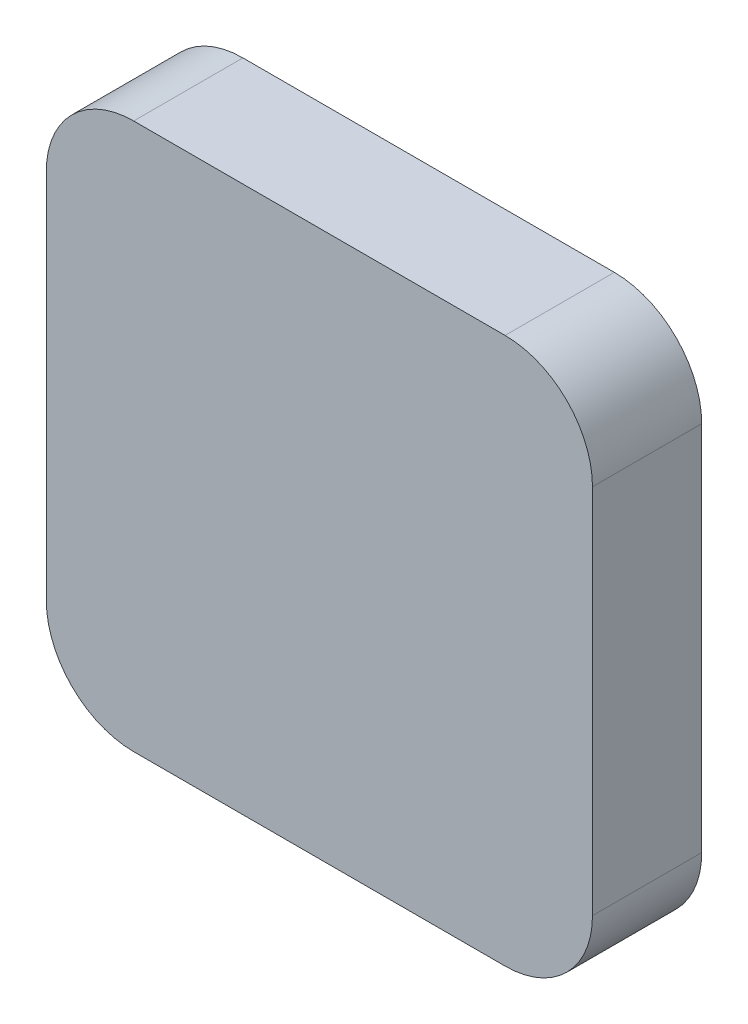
ISO-10303-21;
HEADER;
FILE_DESCRIPTION(('STEP AP214'),'2;1');
FILE_NAME('part.step','',(''),(''),'','','');
FILE_SCHEMA(('AUTOMOTIVE_DESIGN { 1 0 10303 214 1 1 1 1 }'));
ENDSEC;
DATA;
#1=APPLICATION_CONTEXT('core data for automotive mechanical design processes');
#2=APPLICATION_PROTOCOL_DEFINITION('international standard','automotive_design',2000,#1);
#3=PRODUCT_CONTEXT('',#1,'mechanical');
#4=PRODUCT('Part','Part','',(#3));
#5=PRODUCT_RELATED_PRODUCT_CATEGORY('part','',(#4));
#6=PRODUCT_DEFINITION_FORMATION('','',#4);
#7=PRODUCT_DEFINITION_CONTEXT('part definition',#1,'design');
#8=PRODUCT_DEFINITION('design','',#6,#7);
#9=PRODUCT_DEFINITION_SHAPE('','',#8);
#10=(LENGTH_UNIT() NAMED_UNIT(*) SI_UNIT(.MILLI.,.METRE.));
#11=(NAMED_UNIT(*) PLANE_ANGLE_UNIT() SI_UNIT($,.RADIAN.));
#12=(NAMED_UNIT(*) SI_UNIT($,.STERADIAN.) SOLID_ANGLE_UNIT());
#13=UNCERTAINTY_MEASURE_WITH_UNIT(LENGTH_MEASURE(1.E-05),#10,'distance_accuracy_value','');
#14=(GEOMETRIC_REPRESENTATION_CONTEXT(3) GLOBAL_UNCERTAINTY_ASSIGNED_CONTEXT((#13)) GLOBAL_UNIT_ASSIGNED_CONTEXT((#10,
#11,#12)) REPRESENTATION_CONTEXT('',''));
#15=CARTESIAN_POINT('',(0.,0.,0.));
#16=DIRECTION('',(0.,0.,1.));
#17=DIRECTION('',(1.,0.,0.));
#18=AXIS2_PLACEMENT_3D('',#15,#16,#17);
#19=CARTESIAN_POINT('',(12.5,12.5,5.));
#20=DIRECTION('',(-1.,0.,0.));
#21=DIRECTION('',(0.,-1.,0.));
#22=AXIS2_PLACEMENT_3D('',#19,#20,#21);
#23=PLANE('',#22);
#24=DIRECTION('',(0.,1.,0.));
#25=VECTOR('',#24,1.);
#26=CARTESIAN_POINT('',(12.5,12.5,5.));
#27=LINE('',#26,#25);
#28=CARTESIAN_POINT('',(12.5,-8.5,5.));
#29=VERTEX_POINT('',#28);
#30=CARTESIAN_POINT('',(12.5,8.5,5.));
#31=VERTEX_POINT('',#30);
#32=EDGE_CURVE('E120',#29,#31,#27,.T.);
#33=ORIENTED_EDGE('',*,*,#32,.F.);
#34=DIRECTION('',(0.,0.,-1.));
#35=VECTOR('',#34,1.);
#36=CARTESIAN_POINT('',(12.5,-8.5,5.));
#37=LINE('',#36,#35);
#38=CARTESIAN_POINT('',(12.5,-8.5,0.));
#39=VERTEX_POINT('',#38);
#40=EDGE_CURVE('E105',#29,#39,#37,.T.);
#41=ORIENTED_EDGE('',*,*,#40,.T.);
#42=DIRECTION('',(0.,1.,0.));
#43=VECTOR('',#42,1.);
#44=CARTESIAN_POINT('',(12.5,12.5,0.));
#45=LINE('',#44,#43);
#46=CARTESIAN_POINT('',(12.5,8.5,0.));
#47=VERTEX_POINT('',#46);
#48=EDGE_CURVE('E117',#39,#47,#45,.T.);
#49=ORIENTED_EDGE('',*,*,#48,.T.);
#50=DIRECTION('',(0.,0.,-1.));
#51=VECTOR('',#50,1.);
#52=CARTESIAN_POINT('',(12.5,8.5,5.));
#53=LINE('',#52,#51);
#54=EDGE_CURVE('E122',#47,#31,#53,.F.);
#55=ORIENTED_EDGE('',*,*,#54,.T.);
#56=EDGE_LOOP('',(#33,#41,#49,#55));
#57=FACE_BOUND('',#56,.T.);
#58=ADVANCED_FACE('F35',(#57),#23,.F.);
#59=CARTESIAN_POINT('',(-12.5,12.5,5.));
#60=DIRECTION('',(0.,-1.,0.));
#61=DIRECTION('',(0.,0.,-1.));
#62=AXIS2_PLACEMENT_3D('',#59,#60,#61);
#63=PLANE('',#62);
#64=DIRECTION('',(-1.,0.,0.));
#65=VECTOR('',#64,1.);
#66=CARTESIAN_POINT('',(-12.5,12.5,0.));
#67=LINE('',#66,#65);
#68=CARTESIAN_POINT('',(8.5,12.5,0.));
#69=VERTEX_POINT('',#68);
#70=CARTESIAN_POINT('',(-8.5,12.5,0.));
#71=VERTEX_POINT('',#70);
#72=EDGE_CURVE('E126',#69,#71,#67,.T.);
#73=ORIENTED_EDGE('',*,*,#72,.T.);
#74=DIRECTION('',(0.,0.,-1.));
#75=VECTOR('',#74,1.);
#76=CARTESIAN_POINT('',(-8.5,12.5,5.));
#77=LINE('',#76,#75);
#78=CARTESIAN_POINT('',(-8.5,12.5,5.));
#79=VERTEX_POINT('',#78);
#80=EDGE_CURVE('E11',#71,#79,#77,.F.);
#81=ORIENTED_EDGE('',*,*,#80,.T.);
#82=DIRECTION('',(-1.,0.,0.));
#83=VECTOR('',#82,1.);
#84=CARTESIAN_POINT('',(-12.5,12.5,5.));
#85=LINE('',#84,#83);
#86=CARTESIAN_POINT('',(8.5,12.5,5.));
#87=VERTEX_POINT('',#86);
#88=EDGE_CURVE('E162',#87,#79,#85,.T.);
#89=ORIENTED_EDGE('',*,*,#88,.F.);
#90=DIRECTION('',(0.,0.,-1.));
#91=VECTOR('',#90,1.);
#92=CARTESIAN_POINT('',(8.5,12.5,5.));
#93=LINE('',#92,#91);
#94=EDGE_CURVE('E43',#87,#69,#93,.T.);
#95=ORIENTED_EDGE('',*,*,#94,.T.);
#96=EDGE_LOOP('',(#73,#81,#89,#95));
#97=FACE_BOUND('',#96,.T.);
#98=ADVANCED_FACE('F160',(#97),#63,.F.);
#99=CARTESIAN_POINT('',(-12.5,12.5,5.));
#100=DIRECTION('',(1.,0.,0.));
#101=DIRECTION('',(0.,1.,0.));
#102=AXIS2_PLACEMENT_3D('',#99,#100,#101);
#103=PLANE('',#102);
#104=DIRECTION('',(0.,-1.,0.));
#105=VECTOR('',#104,1.);
#106=CARTESIAN_POINT('',(-12.5,12.5,0.));
#107=LINE('',#106,#105);
#108=CARTESIAN_POINT('',(-12.5,8.5,0.));
#109=VERTEX_POINT('',#108);
#110=CARTESIAN_POINT('',(-12.5,-8.5,0.));
#111=VERTEX_POINT('',#110);
#112=EDGE_CURVE('E129',#109,#111,#107,.T.);
#113=ORIENTED_EDGE('',*,*,#112,.T.);
#114=DIRECTION('',(0.,0.,-1.));
#115=VECTOR('',#114,1.);
#116=CARTESIAN_POINT('',(-12.5,-8.5,5.));
#117=LINE('',#116,#115);
#118=CARTESIAN_POINT('',(-12.5,-8.5,5.));
#119=VERTEX_POINT('',#118);
#120=EDGE_CURVE('E50',#111,#119,#117,.F.);
#121=ORIENTED_EDGE('',*,*,#120,.T.);
#122=DIRECTION('',(0.,-1.,0.));
#123=VECTOR('',#122,1.);
#124=CARTESIAN_POINT('',(-12.5,12.5,5.));
#125=LINE('',#124,#123);
#126=CARTESIAN_POINT('',(-12.5,8.5,5.));
#127=VERTEX_POINT('',#126);
#128=EDGE_CURVE('E170',#127,#119,#125,.T.);
#129=ORIENTED_EDGE('',*,*,#128,.F.);
#130=DIRECTION('',(0.,0.,-1.));
#131=VECTOR('',#130,1.);
#132=CARTESIAN_POINT('',(-12.5,8.5,5.));
#133=LINE('',#132,#131);
#134=EDGE_CURVE('E153',#127,#109,#133,.T.);
#135=ORIENTED_EDGE('',*,*,#134,.T.);
#136=EDGE_LOOP('',(#113,#121,#129,#135));
#137=FACE_BOUND('',#136,.T.);
#138=ADVANCED_FACE('F169',(#137),#103,.F.);
#139=CARTESIAN_POINT('',(-12.5,-12.5,5.));
#140=DIRECTION('',(0.,1.,0.));
#141=DIRECTION('',(0.,0.,1.));
#142=AXIS2_PLACEMENT_3D('',#139,#140,#141);
#143=PLANE('',#142);
#144=DIRECTION('',(1.,0.,0.));
#145=VECTOR('',#144,1.);
#146=CARTESIAN_POINT('',(-12.5,-12.5,0.));
#147=LINE('',#146,#145);
#148=CARTESIAN_POINT('',(-8.5,-12.5,0.));
#149=VERTEX_POINT('',#148);
#150=CARTESIAN_POINT('',(8.5,-12.5,0.));
#151=VERTEX_POINT('',#150);
#152=EDGE_CURVE('E136',#149,#151,#147,.T.);
#153=ORIENTED_EDGE('',*,*,#152,.T.);
#154=DIRECTION('',(0.,0.,-1.));
#155=VECTOR('',#154,1.);
#156=CARTESIAN_POINT('',(8.5,-12.5,5.));
#157=LINE('',#156,#155);
#158=CARTESIAN_POINT('',(8.5,-12.5,5.));
#159=VERTEX_POINT('',#158);
#160=EDGE_CURVE('E106',#151,#159,#157,.F.);
#161=ORIENTED_EDGE('',*,*,#160,.T.);
#162=DIRECTION('',(1.,0.,0.));
#163=VECTOR('',#162,1.);
#164=CARTESIAN_POINT('',(-12.5,-12.5,5.));
#165=LINE('',#164,#163);
#166=CARTESIAN_POINT('',(-8.5,-12.5,5.));
#167=VERTEX_POINT('',#166);
#168=EDGE_CURVE('E132',#167,#159,#165,.T.);
#169=ORIENTED_EDGE('',*,*,#168,.F.);
#170=DIRECTION('',(0.,0.,-1.));
#171=VECTOR('',#170,1.);
#172=CARTESIAN_POINT('',(-8.5,-12.5,5.));
#173=LINE('',#172,#171);
#174=EDGE_CURVE('E111',#167,#149,#173,.T.);
#175=ORIENTED_EDGE('',*,*,#174,.T.);
#176=EDGE_LOOP('',(#153,#161,#169,#175));
#177=FACE_BOUND('',#176,.T.);
#178=ADVANCED_FACE('F198',(#177),#143,.F.);
#179=CARTESIAN_POINT('',(12.5,-12.5,5.));
#180=DIRECTION('',(0.,0.,1.));
#181=DIRECTION('',(1.,0.,0.));
#182=AXIS2_PLACEMENT_3D('',#179,#180,#181);
#183=PLANE('',#182);
#184=ORIENTED_EDGE('',*,*,#168,.T.);
#185=CARTESIAN_POINT('',(8.5,-8.5,5.));
#186=DIRECTION('',(0.,0.,1.));
#187=DIRECTION('',(1.,0.,0.));
#188=AXIS2_PLACEMENT_3D('',#185,#186,#187);
#189=CIRCLE('',#188,4.);
#190=EDGE_CURVE('E151',#159,#29,#189,.T.);
#191=ORIENTED_EDGE('',*,*,#190,.T.);
#192=ORIENTED_EDGE('',*,*,#32,.T.);
#193=CARTESIAN_POINT('',(8.5,8.5,5.));
#194=DIRECTION('',(0.,0.,1.));
#195=DIRECTION('',(1.,0.,0.));
#196=AXIS2_PLACEMENT_3D('',#193,#194,#195);
#197=CIRCLE('',#196,4.);
#198=EDGE_CURVE('E146',#31,#87,#197,.T.);
#199=ORIENTED_EDGE('',*,*,#198,.T.);
#200=ORIENTED_EDGE('',*,*,#88,.T.);
#201=CARTESIAN_POINT('',(-8.5,8.5,5.));
#202=DIRECTION('',(0.,0.,1.));
#203=DIRECTION('',(1.,0.,0.));
#204=AXIS2_PLACEMENT_3D('',#201,#202,#203);
#205=CIRCLE('',#204,4.);
#206=EDGE_CURVE('E57',#79,#127,#205,.T.);
#207=ORIENTED_EDGE('',*,*,#206,.T.);
#208=ORIENTED_EDGE('',*,*,#128,.T.);
#209=CARTESIAN_POINT('',(-8.5,-8.5,5.));
#210=DIRECTION('',(0.,0.,1.));
#211=DIRECTION('',(1.,0.,0.));
#212=AXIS2_PLACEMENT_3D('',#209,#210,#211);
#213=CIRCLE('',#212,4.);
#214=EDGE_CURVE('E149',#119,#167,#213,.T.);
#215=ORIENTED_EDGE('',*,*,#214,.T.);
#216=EDGE_LOOP('',(#184,#191,#192,#199,#200,#207,#208,#215));
#217=FACE_BOUND('',#216,.T.);
#218=ADVANCED_FACE('F175',(#217),#183,.T.);
#219=CARTESIAN_POINT('',(12.5,-12.5,0.));
#220=DIRECTION('',(0.,0.,1.));
#221=DIRECTION('',(1.,0.,0.));
#222=AXIS2_PLACEMENT_3D('',#219,#220,#221);
#223=PLANE('',#222);
#224=ORIENTED_EDGE('',*,*,#48,.F.);
#225=CARTESIAN_POINT('',(8.5,-8.5,0.));
#226=DIRECTION('',(0.,0.,1.));
#227=DIRECTION('',(1.,0.,0.));
#228=AXIS2_PLACEMENT_3D('',#225,#226,#227);
#229=CIRCLE('',#228,4.);
#230=EDGE_CURVE('E101',#39,#151,#229,.F.);
#231=ORIENTED_EDGE('',*,*,#230,.T.);
#232=ORIENTED_EDGE('',*,*,#152,.F.);
#233=CARTESIAN_POINT('',(-8.5,-8.5,0.));
#234=DIRECTION('',(0.,0.,1.));
#235=DIRECTION('',(1.,0.,0.));
#236=AXIS2_PLACEMENT_3D('',#233,#234,#235);
#237=CIRCLE('',#236,4.);
#238=EDGE_CURVE('E112',#149,#111,#237,.F.);
#239=ORIENTED_EDGE('',*,*,#238,.T.);
#240=ORIENTED_EDGE('',*,*,#112,.F.);
#241=CARTESIAN_POINT('',(-8.5,8.5,0.));
#242=DIRECTION('',(0.,0.,1.));
#243=DIRECTION('',(1.,0.,0.));
#244=AXIS2_PLACEMENT_3D('',#241,#242,#243);
#245=CIRCLE('',#244,4.);
#246=EDGE_CURVE('E140',#109,#71,#245,.F.);
#247=ORIENTED_EDGE('',*,*,#246,.T.);
#248=ORIENTED_EDGE('',*,*,#72,.F.);
#249=CARTESIAN_POINT('',(8.5,8.5,0.));
#250=DIRECTION('',(0.,0.,1.));
#251=DIRECTION('',(1.,0.,0.));
#252=AXIS2_PLACEMENT_3D('',#249,#250,#251);
#253=CIRCLE('',#252,4.);
#254=EDGE_CURVE('E121',#69,#47,#253,.F.);
#255=ORIENTED_EDGE('',*,*,#254,.T.);
#256=EDGE_LOOP('',(#224,#231,#232,#239,#240,#247,#248,#255));
#257=FACE_BOUND('',#256,.T.);
#258=ADVANCED_FACE('F124',(#257),#223,.F.);
#259=CARTESIAN_POINT('',(8.5,-8.5,5.));
#260=DIRECTION('',(0.,0.,-1.));
#261=DIRECTION('',(-1.,0.,0.));
#262=AXIS2_PLACEMENT_3D('',#259,#260,#261);
#263=CYLINDRICAL_SURFACE('',#262,4.);
#264=ORIENTED_EDGE('',*,*,#190,.F.);
#265=ORIENTED_EDGE('',*,*,#160,.F.);
#266=ORIENTED_EDGE('',*,*,#230,.F.);
#267=ORIENTED_EDGE('',*,*,#40,.F.);
#268=EDGE_LOOP('',(#264,#265,#266,#267));
#269=FACE_BOUND('',#268,.T.);
#270=ADVANCED_FACE('F104',(#269),#263,.T.);
#271=CARTESIAN_POINT('',(-8.5,-8.5,5.));
#272=DIRECTION('',(0.,0.,-1.));
#273=DIRECTION('',(-1.,0.,0.));
#274=AXIS2_PLACEMENT_3D('',#271,#272,#273);
#275=CYLINDRICAL_SURFACE('',#274,4.);
#276=ORIENTED_EDGE('',*,*,#214,.F.);
#277=ORIENTED_EDGE('',*,*,#120,.F.);
#278=ORIENTED_EDGE('',*,*,#238,.F.);
#279=ORIENTED_EDGE('',*,*,#174,.F.);
#280=EDGE_LOOP('',(#276,#277,#278,#279));
#281=FACE_BOUND('',#280,.T.);
#282=ADVANCED_FACE('F180',(#281),#275,.T.);
#283=CARTESIAN_POINT('',(-8.5,8.5,5.));
#284=DIRECTION('',(0.,0.,-1.));
#285=DIRECTION('',(-1.,0.,0.));
#286=AXIS2_PLACEMENT_3D('',#283,#284,#285);
#287=CYLINDRICAL_SURFACE('',#286,4.);
#288=ORIENTED_EDGE('',*,*,#206,.F.);
#289=ORIENTED_EDGE('',*,*,#80,.F.);
#290=ORIENTED_EDGE('',*,*,#246,.F.);
#291=ORIENTED_EDGE('',*,*,#134,.F.);
#292=EDGE_LOOP('',(#288,#289,#290,#291));
#293=FACE_BOUND('',#292,.T.);
#294=ADVANCED_FACE('F168',(#293),#287,.T.);
#295=CARTESIAN_POINT('',(8.5,8.5,5.));
#296=DIRECTION('',(0.,0.,-1.));
#297=DIRECTION('',(-1.,0.,0.));
#298=AXIS2_PLACEMENT_3D('',#295,#296,#297);
#299=CYLINDRICAL_SURFACE('',#298,4.);
#300=ORIENTED_EDGE('',*,*,#198,.F.);
#301=ORIENTED_EDGE('',*,*,#54,.F.);
#302=ORIENTED_EDGE('',*,*,#254,.F.);
#303=ORIENTED_EDGE('',*,*,#94,.F.);
#304=EDGE_LOOP('',(#300,#301,#302,#303));
#305=FACE_BOUND('',#304,.T.);
#306=ADVANCED_FACE('F37',(#305),#299,.T.);
#307=CLOSED_SHELL('',(#58,#98,#138,#178,#218,#258,#270,#282,#294,#306));
#308=MANIFOLD_SOLID_BREP('B2',#307);
#309=ADVANCED_BREP_SHAPE_REPRESENTATION('',(#18,#308),#14);
#310=SHAPE_DEFINITION_REPRESENTATION(#9,#309);
ENDSEC;
END-ISO-10303-21;
